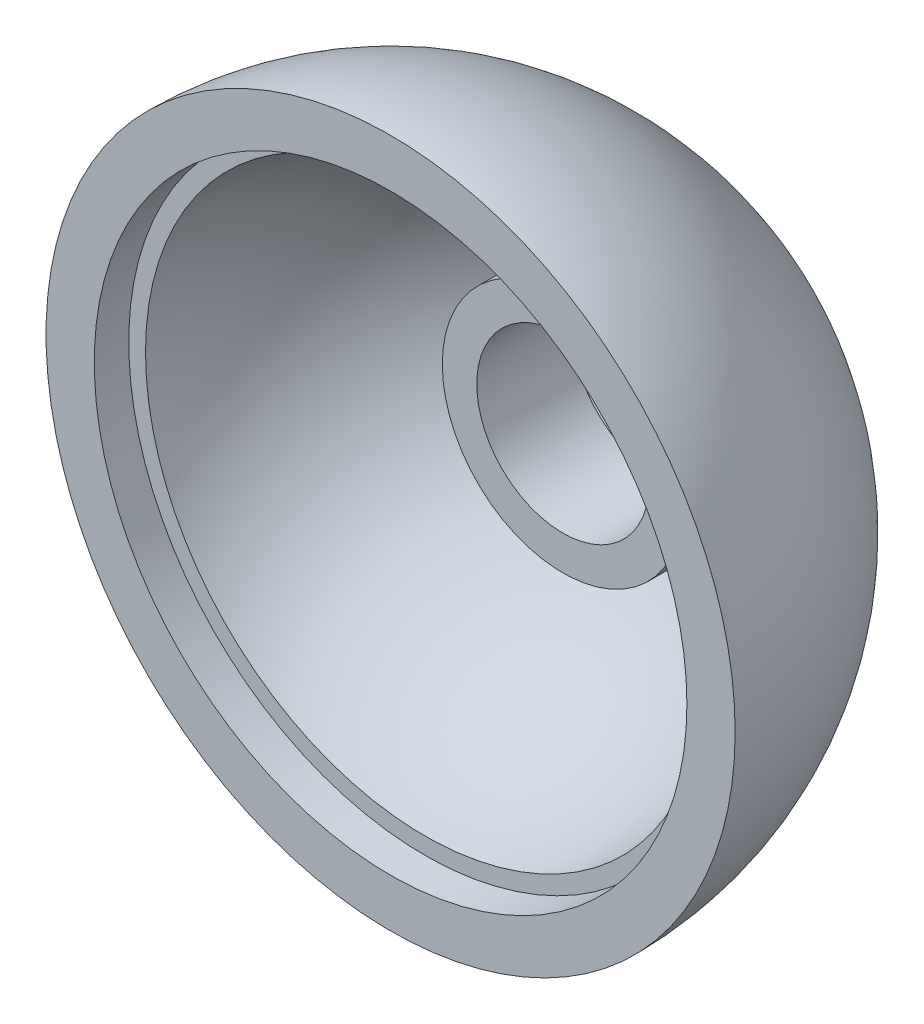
ISO-10303-21;
HEADER;
FILE_DESCRIPTION(('STEP AP214'),'2;1');
FILE_NAME('part.step','',(''),(''),'','','');
FILE_SCHEMA(('AUTOMOTIVE_DESIGN { 1 0 10303 214 1 1 1 1 }'));
ENDSEC;
DATA;
#1=APPLICATION_CONTEXT('core data for automotive mechanical design processes');
#2=APPLICATION_PROTOCOL_DEFINITION('international standard','automotive_design',2000,#1);
#3=PRODUCT_CONTEXT('',#1,'mechanical');
#4=PRODUCT('Part','Part','',(#3));
#5=PRODUCT_RELATED_PRODUCT_CATEGORY('part','',(#4));
#6=PRODUCT_DEFINITION_FORMATION('','',#4);
#7=PRODUCT_DEFINITION_CONTEXT('part definition',#1,'design');
#8=PRODUCT_DEFINITION('design','',#6,#7);
#9=PRODUCT_DEFINITION_SHAPE('','',#8);
#10=(LENGTH_UNIT() NAMED_UNIT(*) SI_UNIT(.MILLI.,.METRE.));
#11=(NAMED_UNIT(*) PLANE_ANGLE_UNIT() SI_UNIT($,.RADIAN.));
#12=(NAMED_UNIT(*) SI_UNIT($,.STERADIAN.) SOLID_ANGLE_UNIT());
#13=UNCERTAINTY_MEASURE_WITH_UNIT(LENGTH_MEASURE(1.E-05),#10,'distance_accuracy_value','');
#14=(GEOMETRIC_REPRESENTATION_CONTEXT(3) GLOBAL_UNCERTAINTY_ASSIGNED_CONTEXT((#13)) GLOBAL_UNIT_ASSIGNED_CONTEXT((#10,
#11,#12)) REPRESENTATION_CONTEXT('',''));
#15=CARTESIAN_POINT('',(0.,0.,0.));
#16=DIRECTION('',(0.,0.,1.));
#17=DIRECTION('',(1.,0.,0.));
#18=AXIS2_PLACEMENT_3D('',#15,#16,#17);
#19=CARTESIAN_POINT('',(-8.6,0.,-1.));
#20=DIRECTION('',(0.,0.,-1.));
#21=DIRECTION('',(-1.,0.,0.));
#22=AXIS2_PLACEMENT_3D('',#19,#20,#21);
#23=PLANE('',#22);
#24=CARTESIAN_POINT('',(0.,0.,-1.));
#25=DIRECTION('',(0.,0.,1.));
#26=DIRECTION('',(1.,0.,0.));
#27=AXIS2_PLACEMENT_3D('',#24,#25,#26);
#28=CIRCLE('',#27,8.11306002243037);
#29=CARTESIAN_POINT('',(-8.11306002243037,0.,-1.));
#30=VERTEX_POINT('',#29);
#31=EDGE_CURVE('E10',#30,#30,#28,.T.);
#32=ORIENTED_EDGE('',*,*,#31,.F.);
#33=EDGE_LOOP('',(#32));
#34=FACE_BOUND('',#33,.T.);
#35=CARTESIAN_POINT('',(0.,0.,-0.999999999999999));
#36=DIRECTION('',(0.,0.,1.));
#37=DIRECTION('',(1.,0.,0.));
#38=AXIS2_PLACEMENT_3D('',#35,#36,#37);
#39=CIRCLE('',#38,8.6);
#40=CARTESIAN_POINT('',(8.6,0.,-0.999999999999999));
#41=VERTEX_POINT('',#40);
#42=EDGE_CURVE('E57',#41,#41,#39,.T.);
#43=ORIENTED_EDGE('',*,*,#42,.T.);
#44=EDGE_LOOP('',(#43));
#45=FACE_BOUND('',#44,.T.);
#46=ADVANCED_FACE('F29',(#34,#45),#23,.F.);
#47=CARTESIAN_POINT('',(0.,0.,0.));
#48=DIRECTION('',(0.,0.,1.));
#49=DIRECTION('',(-1.,0.,0.));
#50=AXIS2_PLACEMENT_3D('',#47,#48,#49);
#51=SPHERICAL_SURFACE('',#50,8.17445673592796);
#52=CARTESIAN_POINT('',(0.,0.,-7.38726897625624));
#53=DIRECTION('',(0.,0.,1.));
#54=DIRECTION('',(1.,0.,0.));
#55=AXIS2_PLACEMENT_3D('',#52,#53,#54);
#56=CIRCLE('',#55,3.5);
#57=CARTESIAN_POINT('',(-3.5,0.,-7.38726897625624));
#58=VERTEX_POINT('',#57);
#59=EDGE_CURVE('E35',#58,#58,#56,.T.);
#60=CARTESIAN_POINT('',(-3.5,0.,-7.38726897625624));
#61=CARTESIAN_POINT('',(-3.57738938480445,0.,-7.3506033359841));
#62=CARTESIAN_POINT('',(-3.65420217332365,0.,-7.31272076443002));
#63=CARTESIAN_POINT('',(-3.80659965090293,0.,-7.23456103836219));
#64=CARTESIAN_POINT('',(-3.88218433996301,0.,-7.19428388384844));
#65=CARTESIAN_POINT('',(-4.03205071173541,0.,-7.11137427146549));
#66=CARTESIAN_POINT('',(-4.10633239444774,0.,-7.06874181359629));
#67=CARTESIAN_POINT('',(-4.25351945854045,0.,-6.98116383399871));
#68=CARTESIAN_POINT('',(-4.32642483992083,0.,-6.93621831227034));
#69=CARTESIAN_POINT('',(-4.47078727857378,0.,-6.84405855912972));
#70=CARTESIAN_POINT('',(-4.54224433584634,0.,-6.79684432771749));
#71=CARTESIAN_POINT('',(-4.68363955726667,0.,-6.70019379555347));
#72=CARTESIAN_POINT('',(-4.75357772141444,0.,-6.65075749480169));
#73=CARTESIAN_POINT('',(-4.89186608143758,0.,-6.54971164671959));
#74=CARTESIAN_POINT('',(-4.96021627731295,0.,-6.49810209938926));
#75=CARTESIAN_POINT('',(-5.09526119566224,0.,-6.39276073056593));
#76=CARTESIAN_POINT('',(-5.16195591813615,0.,-6.33902890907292));
#77=CARTESIAN_POINT('',(-5.29362401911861,0.,-6.22949605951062));
#78=CARTESIAN_POINT('',(-5.35859739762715,0.,-6.17369503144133));
#79=CARTESIAN_POINT('',(-5.48675864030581,0.,-6.06007888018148));
#80=CARTESIAN_POINT('',(-5.54994650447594,0.,-6.00226375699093));
#81=CARTESIAN_POINT('',(-5.67447431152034,0.,-5.88467651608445));
#82=CARTESIAN_POINT('',(-5.73581425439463,0.,-5.82490439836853));
#83=CARTESIAN_POINT('',(-5.85658563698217,0.,-5.70346220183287));
#84=CARTESIAN_POINT('',(-5.91601707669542,0.,-5.64179212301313));
#85=CARTESIAN_POINT('',(-6.03291275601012,0.,-5.51661491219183));
#86=CARTESIAN_POINT('',(-6.09037699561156,0.,-5.45310778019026));
#87=CARTESIAN_POINT('',(-6.20328152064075,0.,-5.3243191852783));
#88=CARTESIAN_POINT('',(-6.25872180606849,0.,-5.2590377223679));
#89=CARTESIAN_POINT('',(-6.36752366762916,0.,-5.12676494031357));
#90=CARTESIAN_POINT('',(-6.42088524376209,0.,-5.05977362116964));
#91=CARTESIAN_POINT('',(-6.5254769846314,0.,-4.92414729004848));
#92=CARTESIAN_POINT('',(-6.57670714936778,0.,-4.85551227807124));
#93=CARTESIAN_POINT('',(-6.67698547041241,0.,-4.71666634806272));
#94=CARTESIAN_POINT('',(-6.72603362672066,0.,-4.64645543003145));
#95=CARTESIAN_POINT('',(-6.82189948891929,0.,-4.5045270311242));
#96=CARTESIAN_POINT('',(-6.86871719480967,0.,-4.43280955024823));
#97=CARTESIAN_POINT('',(-6.96007591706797,0.,-4.28793885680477));
#98=CARTESIAN_POINT('',(-7.0046169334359,0.,-4.21478564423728));
#99=CARTESIAN_POINT('',(-7.09137828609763,0.,-4.06711573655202));
#100=CARTESIAN_POINT('',(-7.13359862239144,0.,-3.99259904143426));
#101=CARTESIAN_POINT('',(-7.21567691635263,0.,-3.84227576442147));
#102=CARTESIAN_POINT('',(-7.25553487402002,0.,-3.76646918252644));
#103=CARTESIAN_POINT('',(-7.33284904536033,0.,-3.6136410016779));
#104=CARTESIAN_POINT('',(-7.37030525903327,0.,-3.5366194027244));
#105=CARTESIAN_POINT('',(-7.44277894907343,0.,-3.38143725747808));
#106=CARTESIAN_POINT('',(-7.47779642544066,0.,-3.30327671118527));
#107=CARTESIAN_POINT('',(-7.54535805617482,0.,-3.14589386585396));
#108=CARTESIAN_POINT('',(-7.57790221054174,0.,-3.06667156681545));
#109=CARTESIAN_POINT('',(-7.64048505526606,0.,-2.90724345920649));
#110=CARTESIAN_POINT('',(-7.67052374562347,0.,-2.82703765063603));
#111=CARTESIAN_POINT('',(-7.72806599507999,0.,-2.66572173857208));
#112=CARTESIAN_POINT('',(-7.75556955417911,0.,-2.5846116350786));
#113=CARTESIAN_POINT('',(-7.80801437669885,0.,-2.42156724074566));
#114=CARTESIAN_POINT('',(-7.83295564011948,0.,-2.33963294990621));
#115=CARTESIAN_POINT('',(-7.88025124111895,0.,-2.17502110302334));
#116=CARTESIAN_POINT('',(-7.90260557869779,0.,-2.09234354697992));
#117=CARTESIAN_POINT('',(-7.94470523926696,0.,-1.92632682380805));
#118=CARTESIAN_POINT('',(-7.96445056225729,0.,-1.8429876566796));
#119=CARTESIAN_POINT('',(-8.00131273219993,0.,-1.67573002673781));
#120=CARTESIAN_POINT('',(-8.01842957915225,0.,-1.59181156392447));
#121=CARTESIAN_POINT('',(-8.05001774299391,0.,-1.42347820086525));
#122=CARTESIAN_POINT('',(-8.06448905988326,0.,-1.33906330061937));
#123=CARTESIAN_POINT('',(-8.09077242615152,0.,-1.16982052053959));
#124=CARTESIAN_POINT('',(-8.10258447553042,0.,-1.08499264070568));
#125=CARTESIAN_POINT('',(-8.11306002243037,0.,-1.));
#126=B_SPLINE_CURVE_WITH_KNOTS('',3,(#60,#61,#62,#63,#64,#65,#66,#67,#68,#69,#70,#71,#72,#73,
#74,#75,#76,#77,#78,#79,#80,#81,#82,#83,#84,#85,#86,#87,#88,#89,#90,#91,#92,#93,#94,#95,#96,#97,
#98,#99,#100,#101,#102,#103,#104,#105,#106,#107,#108,#109,#110,#111,#112,#113,#114,#115,#116,
#117,#118,#119,#120,#121,#122,#123,#124,#125),.UNSPECIFIED.,.F.,.F.,(4,2,2,2,2,2,2,2,2,2,2,2,2,
2,2,2,2,2,2,2,2,2,2,2,2,2,2,2,2,2,2,2,4),(0.,0.256896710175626,0.513793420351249,
0.770690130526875,1.0275868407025,1.28448355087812,1.54138026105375,1.79827697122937,
2.055173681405,2.31207039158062,2.56896710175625,2.82586381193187,3.0827605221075,
3.33965723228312,3.59655394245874,3.85345065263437,4.11034736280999,4.36724407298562,
4.62414078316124,4.88103749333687,5.13793420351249,5.39483091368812,5.65172762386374,
5.90862433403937,6.16552104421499,6.42241775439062,6.67931446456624,6.93621117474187,
7.19310788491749,7.45000459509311,7.70690130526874,7.96379801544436,8.22069472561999),.UNSPECIFIED.);
#127=EDGE_CURVE('BSEAM85',#58,#30,#126,.T.);
#128=ORIENTED_EDGE('',*,*,#59,.F.);
#129=ORIENTED_EDGE('',*,*,#31,.T.);
#130=ORIENTED_EDGE('',*,*,#127,.T.);
#131=ORIENTED_EDGE('',*,*,#127,.F.);
#132=EDGE_LOOP('',(#128,#130,#129,#131));
#133=FACE_BOUND('',#132,.T.);
#134=ADVANCED_FACE('F85',(#133),#51,.F.);
#135=CARTESIAN_POINT('',(0.,0.,0.));
#136=DIRECTION('',(0.,0.,1.));
#137=DIRECTION('',(1.,0.,0.));
#138=AXIS2_PLACEMENT_3D('',#135,#136,#137);
#139=CYLINDRICAL_SURFACE('',#138,3.5);
#140=CARTESIAN_POINT('',(0.,0.,-5.));
#141=DIRECTION('',(0.,0.,1.));
#142=DIRECTION('',(1.,0.,0.));
#143=AXIS2_PLACEMENT_3D('',#140,#141,#142);
#144=CIRCLE('',#143,3.5);
#145=CARTESIAN_POINT('',(3.5,0.,-5.));
#146=VERTEX_POINT('',#145);
#147=EDGE_CURVE('E39',#146,#146,#144,.T.);
#148=ORIENTED_EDGE('',*,*,#147,.F.);
#149=EDGE_LOOP('',(#148));
#150=FACE_BOUND('',#149,.T.);
#151=ORIENTED_EDGE('',*,*,#59,.T.);
#152=EDGE_LOOP('',(#151));
#153=FACE_BOUND('',#152,.T.);
#154=ADVANCED_FACE('F90',(#150,#153),#139,.T.);
#155=CARTESIAN_POINT('',(-2.5,0.,-5.));
#156=DIRECTION('',(0.,0.,-1.));
#157=DIRECTION('',(-1.,0.,0.));
#158=AXIS2_PLACEMENT_3D('',#155,#156,#157);
#159=PLANE('',#158);
#160=CARTESIAN_POINT('',(0.,0.,-5.));
#161=DIRECTION('',(0.,0.,1.));
#162=DIRECTION('',(1.,0.,0.));
#163=AXIS2_PLACEMENT_3D('',#160,#161,#162);
#164=CIRCLE('',#163,2.5);
#165=CARTESIAN_POINT('',(2.5,0.,-5.));
#166=VERTEX_POINT('',#165);
#167=EDGE_CURVE('E43',#166,#166,#164,.T.);
#168=ORIENTED_EDGE('',*,*,#167,.F.);
#169=EDGE_LOOP('',(#168));
#170=FACE_BOUND('',#169,.T.);
#171=ORIENTED_EDGE('',*,*,#147,.T.);
#172=EDGE_LOOP('',(#171));
#173=FACE_BOUND('',#172,.T.);
#174=ADVANCED_FACE('F95',(#170,#173),#159,.F.);
#175=CARTESIAN_POINT('',(0.,0.,0.));
#176=DIRECTION('',(0.,0.,1.));
#177=DIRECTION('',(1.,0.,0.));
#178=AXIS2_PLACEMENT_3D('',#175,#176,#177);
#179=CYLINDRICAL_SURFACE('',#178,2.5);
#180=CARTESIAN_POINT('',(0.,0.,-7.78278503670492));
#181=DIRECTION('',(0.,0.,1.));
#182=DIRECTION('',(1.,0.,0.));
#183=AXIS2_PLACEMENT_3D('',#180,#181,#182);
#184=CIRCLE('',#183,2.5);
#185=CARTESIAN_POINT('',(2.5,0.,-7.78278503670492));
#186=VERTEX_POINT('',#185);
#187=EDGE_CURVE('E48',#186,#186,#184,.T.);
#188=ORIENTED_EDGE('',*,*,#187,.F.);
#189=EDGE_LOOP('',(#188));
#190=FACE_BOUND('',#189,.T.);
#191=ORIENTED_EDGE('',*,*,#167,.T.);
#192=EDGE_LOOP('',(#191));
#193=FACE_BOUND('',#192,.T.);
#194=ADVANCED_FACE('F81',(#190,#193),#179,.F.);
#195=CARTESIAN_POINT('',(0.,0.,0.));
#196=DIRECTION('',(0.,0.,1.));
#197=DIRECTION('',(-1.,0.,0.));
#198=AXIS2_PLACEMENT_3D('',#195,#196,#197);
#199=SPHERICAL_SURFACE('',#198,8.17445673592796);
#200=ORIENTED_EDGE('',*,*,#187,.T.);
#201=EDGE_LOOP('',(#200));
#202=FACE_BOUND('',#201,.T.);
#203=ADVANCED_FACE('F76',(#202),#199,.F.);
#204=CARTESIAN_POINT('',(0.,0.,0.));
#205=DIRECTION('',(0.,0.,1.));
#206=DIRECTION('',(1.,0.,0.));
#207=AXIS2_PLACEMENT_3D('',#204,#205,#206);
#208=SPHERICAL_SURFACE('',#207,10.);
#209=CARTESIAN_POINT('',(0.,0.,0.));
#210=DIRECTION('',(0.,0.,1.));
#211=DIRECTION('',(1.,0.,0.));
#212=AXIS2_PLACEMENT_3D('',#209,#210,#211);
#213=CIRCLE('',#212,10.);
#214=CARTESIAN_POINT('',(10.,0.,0.));
#215=VERTEX_POINT('',#214);
#216=EDGE_CURVE('E51',#215,#215,#213,.T.);
#217=ORIENTED_EDGE('',*,*,#216,.F.);
#218=EDGE_LOOP('',(#217));
#219=FACE_BOUND('',#218,.T.);
#220=ADVANCED_FACE('F71',(#219),#208,.T.);
#221=CARTESIAN_POINT('',(-10.,0.,0.));
#222=DIRECTION('',(0.,0.,-1.));
#223=DIRECTION('',(-1.,0.,0.));
#224=AXIS2_PLACEMENT_3D('',#221,#222,#223);
#225=PLANE('',#224);
#226=CARTESIAN_POINT('',(0.,0.,0.));
#227=DIRECTION('',(0.,0.,1.));
#228=DIRECTION('',(1.,0.,0.));
#229=AXIS2_PLACEMENT_3D('',#226,#227,#228);
#230=CIRCLE('',#229,8.6);
#231=CARTESIAN_POINT('',(8.6,0.,0.));
#232=VERTEX_POINT('',#231);
#233=EDGE_CURVE('E54',#232,#232,#230,.T.);
#234=ORIENTED_EDGE('',*,*,#233,.F.);
#235=EDGE_LOOP('',(#234));
#236=FACE_BOUND('',#235,.T.);
#237=ORIENTED_EDGE('',*,*,#216,.T.);
#238=EDGE_LOOP('',(#237));
#239=FACE_BOUND('',#238,.T.);
#240=ADVANCED_FACE('F65',(#236,#239),#225,.F.);
#241=CARTESIAN_POINT('',(0.,0.,0.));
#242=DIRECTION('',(0.,0.,1.));
#243=DIRECTION('',(1.,0.,0.));
#244=AXIS2_PLACEMENT_3D('',#241,#242,#243);
#245=CYLINDRICAL_SURFACE('',#244,8.6);
#246=ORIENTED_EDGE('',*,*,#42,.F.);
#247=EDGE_LOOP('',(#246));
#248=FACE_BOUND('',#247,.T.);
#249=ORIENTED_EDGE('',*,*,#233,.T.);
#250=EDGE_LOOP('',(#249));
#251=FACE_BOUND('',#250,.T.);
#252=ADVANCED_FACE('F62',(#248,#251),#245,.F.);
#253=CLOSED_SHELL('',(#46,#134,#154,#174,#194,#203,#220,#240,#252));
#254=MANIFOLD_SOLID_BREP('B2',#253);
#255=ADVANCED_BREP_SHAPE_REPRESENTATION('',(#18,#254),#14);
#256=SHAPE_DEFINITION_REPRESENTATION(#9,#255);
ENDSEC;
END-ISO-10303-21;
